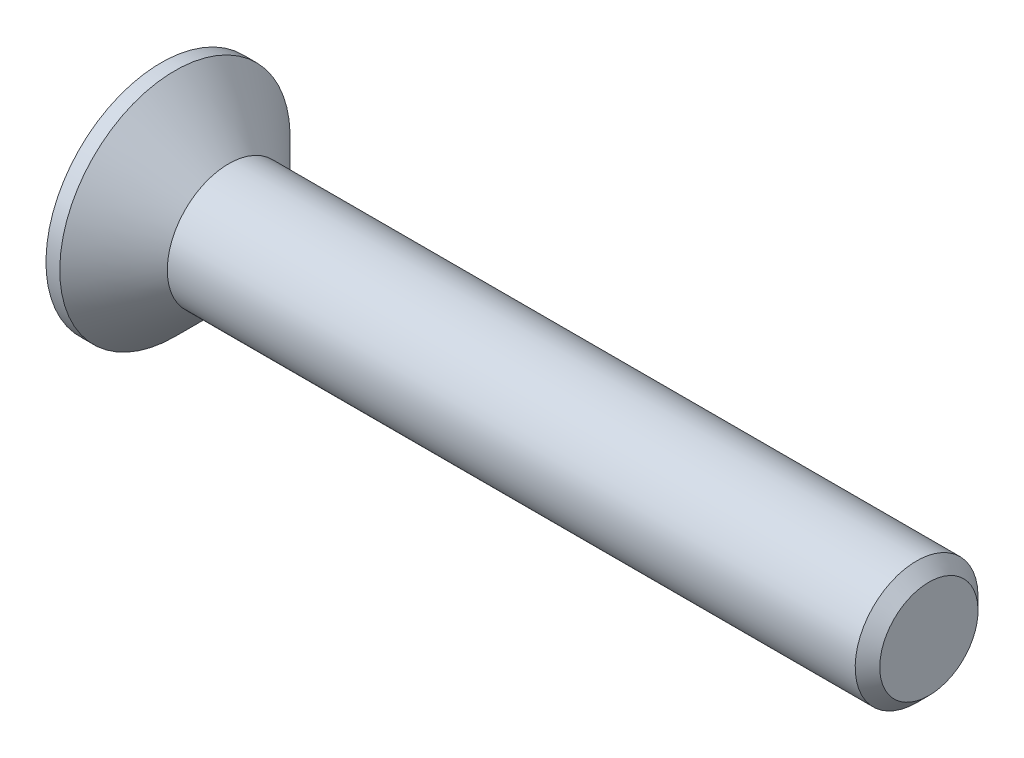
ISO-10303-21;
HEADER;
FILE_DESCRIPTION(('STEP AP214'),'2;1');
FILE_NAME('part.step','',(''),(''),'','','');
FILE_SCHEMA(('AUTOMOTIVE_DESIGN { 1 0 10303 214 1 1 1 1 }'));
ENDSEC;
DATA;
#1=APPLICATION_CONTEXT('core data for automotive mechanical design processes');
#2=APPLICATION_PROTOCOL_DEFINITION('international standard','automotive_design',2000,#1);
#3=PRODUCT_CONTEXT('',#1,'mechanical');
#4=PRODUCT('Part','Part','',(#3));
#5=PRODUCT_RELATED_PRODUCT_CATEGORY('part','',(#4));
#6=PRODUCT_DEFINITION_FORMATION('','',#4);
#7=PRODUCT_DEFINITION_CONTEXT('part definition',#1,'design');
#8=PRODUCT_DEFINITION('design','',#6,#7);
#9=PRODUCT_DEFINITION_SHAPE('','',#8);
#10=(LENGTH_UNIT() NAMED_UNIT(*) SI_UNIT(.MILLI.,.METRE.));
#11=(NAMED_UNIT(*) PLANE_ANGLE_UNIT() SI_UNIT($,.RADIAN.));
#12=(NAMED_UNIT(*) SI_UNIT($,.STERADIAN.) SOLID_ANGLE_UNIT());
#13=UNCERTAINTY_MEASURE_WITH_UNIT(LENGTH_MEASURE(1.E-05),#10,'distance_accuracy_value','');
#14=(GEOMETRIC_REPRESENTATION_CONTEXT(3) GLOBAL_UNCERTAINTY_ASSIGNED_CONTEXT((#13)) GLOBAL_UNIT_ASSIGNED_CONTEXT((#10,
#11,#12)) REPRESENTATION_CONTEXT('',''));
#15=CARTESIAN_POINT('',(0.,0.,0.));
#16=DIRECTION('',(0.,0.,1.));
#17=DIRECTION('',(1.,0.,0.));
#18=AXIS2_PLACEMENT_3D('',#15,#16,#17);
#19=CARTESIAN_POINT('',(0.,0.,0.));
#20=DIRECTION('',(-1.,0.,0.));
#21=DIRECTION('',(0.,-1.,0.));
#22=AXIS2_PLACEMENT_3D('',#19,#20,#21);
#23=CONICAL_SURFACE('',#22,2.,0.78539816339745);
#24=CARTESIAN_POINT('',(-1.74999999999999,0.,0.));
#25=DIRECTION('',(-1.,0.,0.));
#26=DIRECTION('',(0.,-1.,0.));
#27=AXIS2_PLACEMENT_3D('',#24,#25,#26);
#28=CIRCLE('',#27,3.75);
#29=CARTESIAN_POINT('',(-1.74999999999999,-3.75,0.));
#30=VERTEX_POINT('',#29);
#31=EDGE_CURVE('E189',#30,#30,#28,.T.);
#32=ORIENTED_EDGE('',*,*,#31,.F.);
#33=EDGE_LOOP('',(#32));
#34=FACE_BOUND('',#33,.T.);
#35=CARTESIAN_POINT('',(0.,0.,0.));
#36=DIRECTION('',(-1.,0.,0.));
#37=DIRECTION('',(0.,-1.,0.));
#38=AXIS2_PLACEMENT_3D('',#35,#36,#37);
#39=CIRCLE('',#38,2.);
#40=CARTESIAN_POINT('',(0.,-2.,0.));
#41=VERTEX_POINT('',#40);
#42=EDGE_CURVE('E212',#41,#41,#39,.T.);
#43=ORIENTED_EDGE('',*,*,#42,.T.);
#44=EDGE_LOOP('',(#43));
#45=FACE_BOUND('',#44,.T.);
#46=ADVANCED_FACE('F33',(#34,#45),#23,.T.);
#47=CARTESIAN_POINT('',(-2.2,0.,0.));
#48=DIRECTION('',(-1.,0.,0.));
#49=DIRECTION('',(0.,-1.,0.));
#50=AXIS2_PLACEMENT_3D('',#47,#48,#49);
#51=CYLINDRICAL_SURFACE('',#50,2.);
#52=CARTESIAN_POINT('',(22.4,0.,0.));
#53=DIRECTION('',(-1.,0.,0.));
#54=DIRECTION('',(0.,-1.,0.));
#55=AXIS2_PLACEMENT_3D('',#52,#53,#54);
#56=CIRCLE('',#55,2.);
#57=CARTESIAN_POINT('',(22.4,-2.,0.));
#58=VERTEX_POINT('',#57);
#59=EDGE_CURVE('E41',#58,#58,#56,.T.);
#60=ORIENTED_EDGE('',*,*,#59,.T.);
#61=EDGE_LOOP('',(#60));
#62=FACE_BOUND('',#61,.T.);
#63=ORIENTED_EDGE('',*,*,#42,.F.);
#64=EDGE_LOOP('',(#63));
#65=FACE_BOUND('',#64,.T.);
#66=ADVANCED_FACE('F217',(#62,#65),#51,.T.);
#67=CARTESIAN_POINT('',(22.8,0.,0.));
#68=DIRECTION('',(-1.,0.,0.));
#69=DIRECTION('',(0.,-1.,0.));
#70=AXIS2_PLACEMENT_3D('',#67,#68,#69);
#71=PLANE('',#70);
#72=CARTESIAN_POINT('',(22.8,0.,0.));
#73=DIRECTION('',(-1.,0.,0.));
#74=DIRECTION('',(0.,-1.,0.));
#75=AXIS2_PLACEMENT_3D('',#72,#73,#74);
#76=CIRCLE('',#75,1.60000000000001);
#77=CARTESIAN_POINT('',(22.8,-1.60000000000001,0.));
#78=VERTEX_POINT('',#77);
#79=EDGE_CURVE('E11',#78,#78,#76,.F.);
#80=ORIENTED_EDGE('',*,*,#79,.T.);
#81=EDGE_LOOP('',(#80));
#82=FACE_BOUND('',#81,.T.);
#83=ADVANCED_FACE('F239',(#82),#71,.F.);
#84=CARTESIAN_POINT('',(-2.2,3.75,0.));
#85=DIRECTION('',(1.,0.,0.));
#86=DIRECTION('',(0.,1.,0.));
#87=AXIS2_PLACEMENT_3D('',#84,#85,#86);
#88=PLANE('',#87);
#89=DIRECTION('',(0.,0.,-1.));
#90=VECTOR('',#89,1.);
#91=CARTESIAN_POINT('',(-2.2,0.55,-2.2));
#92=LINE('',#91,#90);
#93=CARTESIAN_POINT('',(-2.2,0.55,-0.55));
#94=VERTEX_POINT('',#93);
#95=CARTESIAN_POINT('',(-2.2,0.55,-2.2));
#96=VERTEX_POINT('',#95);
#97=EDGE_CURVE('E158',#94,#96,#92,.T.);
#98=ORIENTED_EDGE('',*,*,#97,.F.);
#99=DIRECTION('',(0.,-1.,0.));
#100=VECTOR('',#99,1.);
#101=CARTESIAN_POINT('',(-2.2,0.55,-0.55));
#102=LINE('',#101,#100);
#103=CARTESIAN_POINT('',(-2.2,2.2,-0.55));
#104=VERTEX_POINT('',#103);
#105=EDGE_CURVE('E48',#104,#94,#102,.T.);
#106=ORIENTED_EDGE('',*,*,#105,.F.);
#107=DIRECTION('',(0.,0.,-1.));
#108=VECTOR('',#107,1.);
#109=CARTESIAN_POINT('',(-2.2,2.2,-0.55));
#110=LINE('',#109,#108);
#111=CARTESIAN_POINT('',(-2.2,2.2,0.55));
#112=VERTEX_POINT('',#111);
#113=EDGE_CURVE('E185',#112,#104,#110,.T.);
#114=ORIENTED_EDGE('',*,*,#113,.F.);
#115=DIRECTION('',(0.,1.,0.));
#116=VECTOR('',#115,1.);
#117=CARTESIAN_POINT('',(-2.2,2.2,0.55));
#118=LINE('',#117,#116);
#119=CARTESIAN_POINT('',(-2.2,0.55,0.55));
#120=VERTEX_POINT('',#119);
#121=EDGE_CURVE('E183',#120,#112,#118,.T.);
#122=ORIENTED_EDGE('',*,*,#121,.F.);
#123=DIRECTION('',(0.,0.,-1.));
#124=VECTOR('',#123,1.);
#125=CARTESIAN_POINT('',(-2.2,0.55,0.55));
#126=LINE('',#125,#124);
#127=CARTESIAN_POINT('',(-2.2,0.55,2.2));
#128=VERTEX_POINT('',#127);
#129=EDGE_CURVE('E132',#128,#120,#126,.T.);
#130=ORIENTED_EDGE('',*,*,#129,.F.);
#131=DIRECTION('',(0.,1.,0.));
#132=VECTOR('',#131,1.);
#133=CARTESIAN_POINT('',(-2.2,0.55,2.2));
#134=LINE('',#133,#132);
#135=CARTESIAN_POINT('',(-2.2,-0.55,2.2));
#136=VERTEX_POINT('',#135);
#137=EDGE_CURVE('E179',#136,#128,#134,.T.);
#138=ORIENTED_EDGE('',*,*,#137,.F.);
#139=DIRECTION('',(0.,0.,1.));
#140=VECTOR('',#139,1.);
#141=CARTESIAN_POINT('',(-2.2,-0.55,2.2));
#142=LINE('',#141,#140);
#143=CARTESIAN_POINT('',(-2.2,-0.55,0.55));
#144=VERTEX_POINT('',#143);
#145=EDGE_CURVE('E176',#144,#136,#142,.T.);
#146=ORIENTED_EDGE('',*,*,#145,.F.);
#147=DIRECTION('',(0.,1.,0.));
#148=VECTOR('',#147,1.);
#149=CARTESIAN_POINT('',(-2.2,-0.55,0.55));
#150=LINE('',#149,#148);
#151=CARTESIAN_POINT('',(-2.2,-2.2,0.55));
#152=VERTEX_POINT('',#151);
#153=EDGE_CURVE('E173',#152,#144,#150,.T.);
#154=ORIENTED_EDGE('',*,*,#153,.F.);
#155=DIRECTION('',(0.,0.,1.));
#156=VECTOR('',#155,1.);
#157=CARTESIAN_POINT('',(-2.2,-2.2,0.55));
#158=LINE('',#157,#156);
#159=CARTESIAN_POINT('',(-2.2,-2.2,-0.55));
#160=VERTEX_POINT('',#159);
#161=EDGE_CURVE('E170',#160,#152,#158,.T.);
#162=ORIENTED_EDGE('',*,*,#161,.F.);
#163=DIRECTION('',(0.,-1.,0.));
#164=VECTOR('',#163,1.);
#165=CARTESIAN_POINT('',(-2.2,-2.2,-0.55));
#166=LINE('',#165,#164);
#167=CARTESIAN_POINT('',(-2.2,-0.55,-0.55));
#168=VERTEX_POINT('',#167);
#169=EDGE_CURVE('E167',#168,#160,#166,.T.);
#170=ORIENTED_EDGE('',*,*,#169,.F.);
#171=DIRECTION('',(0.,0.,1.));
#172=VECTOR('',#171,1.);
#173=CARTESIAN_POINT('',(-2.2,-0.55,-0.55));
#174=LINE('',#173,#172);
#175=CARTESIAN_POINT('',(-2.2,-0.55,-2.2));
#176=VERTEX_POINT('',#175);
#177=EDGE_CURVE('E164',#176,#168,#174,.T.);
#178=ORIENTED_EDGE('',*,*,#177,.F.);
#179=DIRECTION('',(0.,-1.,0.));
#180=VECTOR('',#179,1.);
#181=CARTESIAN_POINT('',(-2.2,-0.55,-2.2));
#182=LINE('',#181,#180);
#183=EDGE_CURVE('E161',#96,#176,#182,.T.);
#184=ORIENTED_EDGE('',*,*,#183,.F.);
#185=EDGE_LOOP('',(#98,#106,#114,#122,#130,#138,#146,#154,#162,#170,#178,#184));
#186=FACE_BOUND('',#185,.T.);
#187=CARTESIAN_POINT('',(-2.2,0.,0.));
#188=DIRECTION('',(-1.,0.,0.));
#189=DIRECTION('',(0.,-1.,0.));
#190=AXIS2_PLACEMENT_3D('',#187,#188,#189);
#191=CIRCLE('',#190,3.75);
#192=CARTESIAN_POINT('',(-2.2,-3.75,0.));
#193=VERTEX_POINT('',#192);
#194=EDGE_CURVE('E209',#193,#193,#191,.T.);
#195=ORIENTED_EDGE('',*,*,#194,.T.);
#196=EDGE_LOOP('',(#195));
#197=FACE_BOUND('',#196,.T.);
#198=ADVANCED_FACE('F230',(#186,#197),#88,.F.);
#199=CARTESIAN_POINT('',(-2.2,0.,0.));
#200=DIRECTION('',(-1.,0.,0.));
#201=DIRECTION('',(0.,-1.,0.));
#202=AXIS2_PLACEMENT_3D('',#199,#200,#201);
#203=CYLINDRICAL_SURFACE('',#202,3.75);
#204=ORIENTED_EDGE('',*,*,#194,.F.);
#205=EDGE_LOOP('',(#204));
#206=FACE_BOUND('',#205,.T.);
#207=ORIENTED_EDGE('',*,*,#31,.T.);
#208=EDGE_LOOP('',(#207));
#209=FACE_BOUND('',#208,.T.);
#210=ADVANCED_FACE('F222',(#206,#209),#203,.T.);
#211=CARTESIAN_POINT('',(22.4,0.,0.));
#212=DIRECTION('',(-1.,0.,0.));
#213=DIRECTION('',(0.,-1.,0.));
#214=AXIS2_PLACEMENT_3D('',#211,#212,#213);
#215=CONICAL_SURFACE('',#214,2.,0.785398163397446);
#216=ORIENTED_EDGE('',*,*,#79,.F.);
#217=EDGE_LOOP('',(#216));
#218=FACE_BOUND('',#217,.T.);
#219=ORIENTED_EDGE('',*,*,#59,.F.);
#220=EDGE_LOOP('',(#219));
#221=FACE_BOUND('',#220,.T.);
#222=ADVANCED_FACE('F35',(#218,#221),#215,.T.);
#223=CARTESIAN_POINT('',(-0.3,0.55,-0.55));
#224=DIRECTION('',(0.,0.,-1.));
#225=DIRECTION('',(-1.,0.,0.));
#226=AXIS2_PLACEMENT_3D('',#223,#224,#225);
#227=PLANE('',#226);
#228=ORIENTED_EDGE('',*,*,#105,.T.);
#229=DIRECTION('',(-1.,0.,0.));
#230=VECTOR('',#229,1.);
#231=CARTESIAN_POINT('',(-0.3,0.55,-0.55));
#232=LINE('',#231,#230);
#233=CARTESIAN_POINT('',(-0.3,0.55,-0.55));
#234=VERTEX_POINT('',#233);
#235=EDGE_CURVE('E96',#234,#94,#232,.T.);
#236=ORIENTED_EDGE('',*,*,#235,.F.);
#237=DIRECTION('',(0.,-1.,0.));
#238=VECTOR('',#237,1.);
#239=CARTESIAN_POINT('',(-0.3,0.55,-0.55));
#240=LINE('',#239,#238);
#241=CARTESIAN_POINT('',(-0.3,2.2,-0.55));
#242=VERTEX_POINT('',#241);
#243=EDGE_CURVE('E187',#242,#234,#240,.T.);
#244=ORIENTED_EDGE('',*,*,#243,.F.);
#245=DIRECTION('',(-1.,0.,0.));
#246=VECTOR('',#245,1.);
#247=CARTESIAN_POINT('',(-0.3,2.2,-0.55));
#248=LINE('',#247,#246);
#249=EDGE_CURVE('E56',#242,#104,#248,.T.);
#250=ORIENTED_EDGE('',*,*,#249,.T.);
#251=EDGE_LOOP('',(#228,#236,#244,#250));
#252=FACE_BOUND('',#251,.T.);
#253=ADVANCED_FACE('F221',(#252),#227,.F.);
#254=CARTESIAN_POINT('',(-0.3,2.2,-0.55));
#255=DIRECTION('',(0.,1.,0.));
#256=DIRECTION('',(-1.,0.,0.));
#257=AXIS2_PLACEMENT_3D('',#254,#255,#256);
#258=PLANE('',#257);
#259=ORIENTED_EDGE('',*,*,#113,.T.);
#260=ORIENTED_EDGE('',*,*,#249,.F.);
#261=DIRECTION('',(0.,0.,-1.));
#262=VECTOR('',#261,1.);
#263=CARTESIAN_POINT('',(-0.3,2.2,-0.55));
#264=LINE('',#263,#262);
#265=CARTESIAN_POINT('',(-0.3,2.2,0.55));
#266=VERTEX_POINT('',#265);
#267=EDGE_CURVE('E144',#266,#242,#264,.T.);
#268=ORIENTED_EDGE('',*,*,#267,.F.);
#269=DIRECTION('',(-1.,0.,0.));
#270=VECTOR('',#269,1.);
#271=CARTESIAN_POINT('',(-0.3,2.2,0.55));
#272=LINE('',#271,#270);
#273=EDGE_CURVE('E136',#266,#112,#272,.T.);
#274=ORIENTED_EDGE('',*,*,#273,.T.);
#275=EDGE_LOOP('',(#259,#260,#268,#274));
#276=FACE_BOUND('',#275,.T.);
#277=ADVANCED_FACE('F228',(#276),#258,.F.);
#278=CARTESIAN_POINT('',(-0.3,2.2,0.55));
#279=DIRECTION('',(0.,0.,1.));
#280=DIRECTION('',(1.,0.,0.));
#281=AXIS2_PLACEMENT_3D('',#278,#279,#280);
#282=PLANE('',#281);
#283=ORIENTED_EDGE('',*,*,#121,.T.);
#284=ORIENTED_EDGE('',*,*,#273,.F.);
#285=DIRECTION('',(0.,1.,0.));
#286=VECTOR('',#285,1.);
#287=CARTESIAN_POINT('',(-0.3,2.2,0.55));
#288=LINE('',#287,#286);
#289=CARTESIAN_POINT('',(-0.3,0.55,0.55));
#290=VERTEX_POINT('',#289);
#291=EDGE_CURVE('E140',#290,#266,#288,.T.);
#292=ORIENTED_EDGE('',*,*,#291,.F.);
#293=DIRECTION('',(-1.,0.,0.));
#294=VECTOR('',#293,1.);
#295=CARTESIAN_POINT('',(-0.3,0.55,0.55));
#296=LINE('',#295,#294);
#297=EDGE_CURVE('E125',#290,#120,#296,.T.);
#298=ORIENTED_EDGE('',*,*,#297,.T.);
#299=EDGE_LOOP('',(#283,#284,#292,#298));
#300=FACE_BOUND('',#299,.T.);
#301=ADVANCED_FACE('F141',(#300),#282,.F.);
#302=CARTESIAN_POINT('',(-0.3,0.55,0.55));
#303=DIRECTION('',(0.,1.,0.));
#304=DIRECTION('',(-1.,0.,0.));
#305=AXIS2_PLACEMENT_3D('',#302,#303,#304);
#306=PLANE('',#305);
#307=ORIENTED_EDGE('',*,*,#129,.T.);
#308=ORIENTED_EDGE('',*,*,#297,.F.);
#309=DIRECTION('',(0.,0.,-1.));
#310=VECTOR('',#309,1.);
#311=CARTESIAN_POINT('',(-0.3,0.55,0.55));
#312=LINE('',#311,#310);
#313=CARTESIAN_POINT('',(-0.3,0.55,2.2));
#314=VERTEX_POINT('',#313);
#315=EDGE_CURVE('E129',#314,#290,#312,.T.);
#316=ORIENTED_EDGE('',*,*,#315,.F.);
#317=DIRECTION('',(-1.,0.,0.));
#318=VECTOR('',#317,1.);
#319=CARTESIAN_POINT('',(-0.3,0.55,2.2));
#320=LINE('',#319,#318);
#321=EDGE_CURVE('E137',#314,#128,#320,.T.);
#322=ORIENTED_EDGE('',*,*,#321,.T.);
#323=EDGE_LOOP('',(#307,#308,#316,#322));
#324=FACE_BOUND('',#323,.T.);
#325=ADVANCED_FACE('F127',(#324),#306,.F.);
#326=CARTESIAN_POINT('',(-0.3,0.55,2.2));
#327=DIRECTION('',(0.,0.,1.));
#328=DIRECTION('',(1.,0.,0.));
#329=AXIS2_PLACEMENT_3D('',#326,#327,#328);
#330=PLANE('',#329);
#331=ORIENTED_EDGE('',*,*,#137,.T.);
#332=ORIENTED_EDGE('',*,*,#321,.F.);
#333=DIRECTION('',(0.,1.,0.));
#334=VECTOR('',#333,1.);
#335=CARTESIAN_POINT('',(-0.3,0.55,2.2));
#336=LINE('',#335,#334);
#337=CARTESIAN_POINT('',(-0.3,-0.55,2.2));
#338=VERTEX_POINT('',#337);
#339=EDGE_CURVE('E150',#338,#314,#336,.T.);
#340=ORIENTED_EDGE('',*,*,#339,.F.);
#341=DIRECTION('',(-1.,0.,0.));
#342=VECTOR('',#341,1.);
#343=CARTESIAN_POINT('',(-0.3,-0.55,2.2));
#344=LINE('',#343,#342);
#345=EDGE_CURVE('E192',#338,#136,#344,.T.);
#346=ORIENTED_EDGE('',*,*,#345,.T.);
#347=EDGE_LOOP('',(#331,#332,#340,#346));
#348=FACE_BOUND('',#347,.T.);
#349=ADVANCED_FACE('F277',(#348),#330,.F.);
#350=CARTESIAN_POINT('',(-0.3,-0.55,2.2));
#351=DIRECTION('',(0.,-1.,0.));
#352=DIRECTION('',(1.,0.,0.));
#353=AXIS2_PLACEMENT_3D('',#350,#351,#352);
#354=PLANE('',#353);
#355=ORIENTED_EDGE('',*,*,#145,.T.);
#356=ORIENTED_EDGE('',*,*,#345,.F.);
#357=DIRECTION('',(0.,0.,1.));
#358=VECTOR('',#357,1.);
#359=CARTESIAN_POINT('',(-0.3,-0.55,2.2));
#360=LINE('',#359,#358);
#361=CARTESIAN_POINT('',(-0.3,-0.55,0.55));
#362=VERTEX_POINT('',#361);
#363=EDGE_CURVE('E152',#362,#338,#360,.T.);
#364=ORIENTED_EDGE('',*,*,#363,.F.);
#365=DIRECTION('',(-1.,0.,0.));
#366=VECTOR('',#365,1.);
#367=CARTESIAN_POINT('',(-0.3,-0.55,0.55));
#368=LINE('',#367,#366);
#369=EDGE_CURVE('E194',#362,#144,#368,.T.);
#370=ORIENTED_EDGE('',*,*,#369,.T.);
#371=EDGE_LOOP('',(#355,#356,#364,#370));
#372=FACE_BOUND('',#371,.T.);
#373=ADVANCED_FACE('F273',(#372),#354,.F.);
#374=CARTESIAN_POINT('',(-0.3,-0.55,0.55));
#375=DIRECTION('',(0.,0.,1.));
#376=DIRECTION('',(1.,0.,0.));
#377=AXIS2_PLACEMENT_3D('',#374,#375,#376);
#378=PLANE('',#377);
#379=ORIENTED_EDGE('',*,*,#153,.T.);
#380=ORIENTED_EDGE('',*,*,#369,.F.);
#381=DIRECTION('',(0.,1.,0.));
#382=VECTOR('',#381,1.);
#383=CARTESIAN_POINT('',(-0.3,-0.55,0.55));
#384=LINE('',#383,#382);
#385=CARTESIAN_POINT('',(-0.3,-2.2,0.55));
#386=VERTEX_POINT('',#385);
#387=EDGE_CURVE('E422',#386,#362,#384,.T.);
#388=ORIENTED_EDGE('',*,*,#387,.F.);
#389=DIRECTION('',(-1.,0.,0.));
#390=VECTOR('',#389,1.);
#391=CARTESIAN_POINT('',(-0.3,-2.2,0.55));
#392=LINE('',#391,#390);
#393=EDGE_CURVE('E196',#386,#152,#392,.T.);
#394=ORIENTED_EDGE('',*,*,#393,.T.);
#395=EDGE_LOOP('',(#379,#380,#388,#394));
#396=FACE_BOUND('',#395,.T.);
#397=ADVANCED_FACE('F269',(#396),#378,.F.);
#398=CARTESIAN_POINT('',(-0.3,-2.2,0.55));
#399=DIRECTION('',(0.,-1.,0.));
#400=DIRECTION('',(1.,0.,0.));
#401=AXIS2_PLACEMENT_3D('',#398,#399,#400);
#402=PLANE('',#401);
#403=ORIENTED_EDGE('',*,*,#161,.T.);
#404=ORIENTED_EDGE('',*,*,#393,.F.);
#405=DIRECTION('',(0.,0.,1.));
#406=VECTOR('',#405,1.);
#407=CARTESIAN_POINT('',(-0.3,-2.2,0.55));
#408=LINE('',#407,#406);
#409=CARTESIAN_POINT('',(-0.3,-2.2,-0.55));
#410=VERTEX_POINT('',#409);
#411=EDGE_CURVE('E419',#410,#386,#408,.T.);
#412=ORIENTED_EDGE('',*,*,#411,.F.);
#413=DIRECTION('',(-1.,0.,0.));
#414=VECTOR('',#413,1.);
#415=CARTESIAN_POINT('',(-0.3,-2.2,-0.55));
#416=LINE('',#415,#414);
#417=EDGE_CURVE('E198',#410,#160,#416,.T.);
#418=ORIENTED_EDGE('',*,*,#417,.T.);
#419=EDGE_LOOP('',(#403,#404,#412,#418));
#420=FACE_BOUND('',#419,.T.);
#421=ADVANCED_FACE('F265',(#420),#402,.F.);
#422=CARTESIAN_POINT('',(-0.3,-2.2,-0.55));
#423=DIRECTION('',(0.,0.,-1.));
#424=DIRECTION('',(-1.,0.,0.));
#425=AXIS2_PLACEMENT_3D('',#422,#423,#424);
#426=PLANE('',#425);
#427=ORIENTED_EDGE('',*,*,#169,.T.);
#428=ORIENTED_EDGE('',*,*,#417,.F.);
#429=DIRECTION('',(0.,-1.,0.));
#430=VECTOR('',#429,1.);
#431=CARTESIAN_POINT('',(-0.3,-2.2,-0.55));
#432=LINE('',#431,#430);
#433=CARTESIAN_POINT('',(-0.3,-0.55,-0.55));
#434=VERTEX_POINT('',#433);
#435=EDGE_CURVE('E416',#434,#410,#432,.T.);
#436=ORIENTED_EDGE('',*,*,#435,.F.);
#437=DIRECTION('',(-1.,0.,0.));
#438=VECTOR('',#437,1.);
#439=CARTESIAN_POINT('',(-0.3,-0.55,-0.55));
#440=LINE('',#439,#438);
#441=EDGE_CURVE('E200',#434,#168,#440,.T.);
#442=ORIENTED_EDGE('',*,*,#441,.T.);
#443=EDGE_LOOP('',(#427,#428,#436,#442));
#444=FACE_BOUND('',#443,.T.);
#445=ADVANCED_FACE('F261',(#444),#426,.F.);
#446=CARTESIAN_POINT('',(-0.3,-0.55,-0.55));
#447=DIRECTION('',(0.,-1.,0.));
#448=DIRECTION('',(1.,0.,0.));
#449=AXIS2_PLACEMENT_3D('',#446,#447,#448);
#450=PLANE('',#449);
#451=ORIENTED_EDGE('',*,*,#177,.T.);
#452=ORIENTED_EDGE('',*,*,#441,.F.);
#453=DIRECTION('',(0.,0.,1.));
#454=VECTOR('',#453,1.);
#455=CARTESIAN_POINT('',(-0.3,-0.55,-0.55));
#456=LINE('',#455,#454);
#457=CARTESIAN_POINT('',(-0.3,-0.55,-2.2));
#458=VERTEX_POINT('',#457);
#459=EDGE_CURVE('E413',#458,#434,#456,.T.);
#460=ORIENTED_EDGE('',*,*,#459,.F.);
#461=DIRECTION('',(-1.,0.,0.));
#462=VECTOR('',#461,1.);
#463=CARTESIAN_POINT('',(-0.3,-0.55,-2.2));
#464=LINE('',#463,#462);
#465=EDGE_CURVE('E202',#458,#176,#464,.T.);
#466=ORIENTED_EDGE('',*,*,#465,.T.);
#467=EDGE_LOOP('',(#451,#452,#460,#466));
#468=FACE_BOUND('',#467,.T.);
#469=ADVANCED_FACE('F257',(#468),#450,.F.);
#470=CARTESIAN_POINT('',(-0.3,-0.55,-2.2));
#471=DIRECTION('',(0.,0.,-1.));
#472=DIRECTION('',(-1.,0.,0.));
#473=AXIS2_PLACEMENT_3D('',#470,#471,#472);
#474=PLANE('',#473);
#475=ORIENTED_EDGE('',*,*,#183,.T.);
#476=ORIENTED_EDGE('',*,*,#465,.F.);
#477=DIRECTION('',(0.,-1.,0.));
#478=VECTOR('',#477,1.);
#479=CARTESIAN_POINT('',(-0.3,-0.55,-2.2));
#480=LINE('',#479,#478);
#481=CARTESIAN_POINT('',(-0.3,0.55,-2.2));
#482=VERTEX_POINT('',#481);
#483=EDGE_CURVE('E408',#482,#458,#480,.T.);
#484=ORIENTED_EDGE('',*,*,#483,.F.);
#485=DIRECTION('',(-1.,0.,0.));
#486=VECTOR('',#485,1.);
#487=CARTESIAN_POINT('',(-0.3,0.55,-2.2));
#488=LINE('',#487,#486);
#489=EDGE_CURVE('E204',#482,#96,#488,.T.);
#490=ORIENTED_EDGE('',*,*,#489,.T.);
#491=EDGE_LOOP('',(#475,#476,#484,#490));
#492=FACE_BOUND('',#491,.T.);
#493=ADVANCED_FACE('F253',(#492),#474,.F.);
#494=CARTESIAN_POINT('',(-0.3,0.55,-2.2));
#495=DIRECTION('',(0.,1.,0.));
#496=DIRECTION('',(-1.,0.,0.));
#497=AXIS2_PLACEMENT_3D('',#494,#495,#496);
#498=PLANE('',#497);
#499=ORIENTED_EDGE('',*,*,#97,.T.);
#500=ORIENTED_EDGE('',*,*,#489,.F.);
#501=DIRECTION('',(0.,0.,-1.));
#502=VECTOR('',#501,1.);
#503=CARTESIAN_POINT('',(-0.3,0.55,-2.2));
#504=LINE('',#503,#502);
#505=EDGE_CURVE('E406',#234,#482,#504,.T.);
#506=ORIENTED_EDGE('',*,*,#505,.F.);
#507=ORIENTED_EDGE('',*,*,#235,.T.);
#508=EDGE_LOOP('',(#499,#500,#506,#507));
#509=FACE_BOUND('',#508,.T.);
#510=ADVANCED_FACE('F250',(#509),#498,.F.);
#511=CARTESIAN_POINT('',(-0.3,0.,0.));
#512=DIRECTION('',(1.,0.,0.));
#513=DIRECTION('',(0.,0.,-1.));
#514=AXIS2_PLACEMENT_3D('',#511,#512,#513);
#515=PLANE('',#514);
#516=ORIENTED_EDGE('',*,*,#243,.T.);
#517=ORIENTED_EDGE('',*,*,#505,.T.);
#518=ORIENTED_EDGE('',*,*,#483,.T.);
#519=ORIENTED_EDGE('',*,*,#459,.T.);
#520=ORIENTED_EDGE('',*,*,#435,.T.);
#521=ORIENTED_EDGE('',*,*,#411,.T.);
#522=ORIENTED_EDGE('',*,*,#387,.T.);
#523=ORIENTED_EDGE('',*,*,#363,.T.);
#524=ORIENTED_EDGE('',*,*,#339,.T.);
#525=ORIENTED_EDGE('',*,*,#315,.T.);
#526=ORIENTED_EDGE('',*,*,#291,.T.);
#527=ORIENTED_EDGE('',*,*,#267,.T.);
#528=EDGE_LOOP('',(#516,#517,#518,#519,#520,#521,#522,#523,#524,#525,#526,#527));
#529=FACE_BOUND('',#528,.T.);
#530=ADVANCED_FACE('F147',(#529),#515,.F.);
#531=CLOSED_SHELL('',(#46,#66,#83,#198,#210,#222,#253,#277,#301,#325,#349,#373,#397,#421,#445,
#469,#493,#510,#530));
#532=MANIFOLD_SOLID_BREP('B2',#531);
#533=ADVANCED_BREP_SHAPE_REPRESENTATION('',(#18,#532),#14);
#534=SHAPE_DEFINITION_REPRESENTATION(#9,#533);
ENDSEC;
END-ISO-10303-21;
